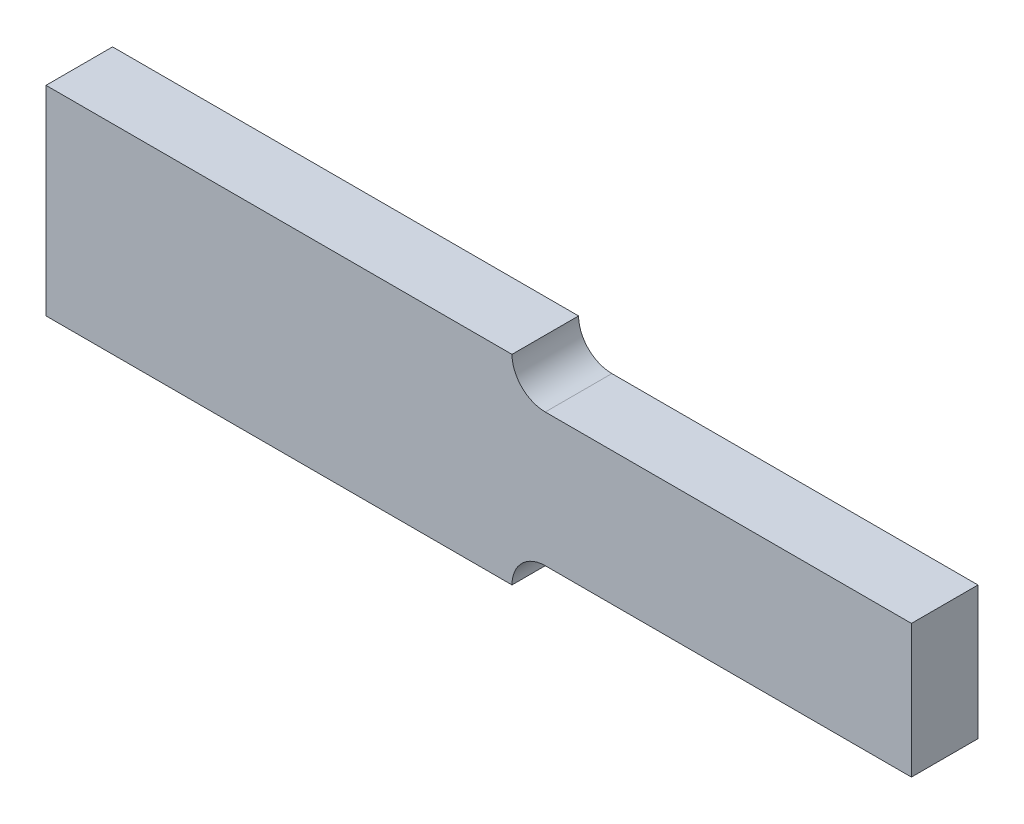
ISO-10303-21;
HEADER;
FILE_DESCRIPTION(('STEP AP214'),'2;1');
FILE_NAME('part.step','',(''),(''),'','','');
FILE_SCHEMA(('AUTOMOTIVE_DESIGN { 1 0 10303 214 1 1 1 1 }'));
ENDSEC;
DATA;
#1=APPLICATION_CONTEXT('core data for automotive mechanical design processes');
#2=APPLICATION_PROTOCOL_DEFINITION('international standard','automotive_design',2000,#1);
#3=PRODUCT_CONTEXT('',#1,'mechanical');
#4=PRODUCT('Part','Part','',(#3));
#5=PRODUCT_RELATED_PRODUCT_CATEGORY('part','',(#4));
#6=PRODUCT_DEFINITION_FORMATION('','',#4);
#7=PRODUCT_DEFINITION_CONTEXT('part definition',#1,'design');
#8=PRODUCT_DEFINITION('design','',#6,#7);
#9=PRODUCT_DEFINITION_SHAPE('','',#8);
#10=(LENGTH_UNIT() NAMED_UNIT(*) SI_UNIT(.MILLI.,.METRE.));
#11=(NAMED_UNIT(*) PLANE_ANGLE_UNIT() SI_UNIT($,.RADIAN.));
#12=(NAMED_UNIT(*) SI_UNIT($,.STERADIAN.) SOLID_ANGLE_UNIT());
#13=UNCERTAINTY_MEASURE_WITH_UNIT(LENGTH_MEASURE(1.E-05),#10,'distance_accuracy_value','');
#14=(GEOMETRIC_REPRESENTATION_CONTEXT(3) GLOBAL_UNCERTAINTY_ASSIGNED_CONTEXT((#13)) GLOBAL_UNIT_ASSIGNED_CONTEXT((#10,
#11,#12)) REPRESENTATION_CONTEXT('',''));
#15=CARTESIAN_POINT('',(0.,0.,0.));
#16=DIRECTION('',(0.,0.,1.));
#17=DIRECTION('',(1.,0.,0.));
#18=AXIS2_PLACEMENT_3D('',#15,#16,#17);
#19=CARTESIAN_POINT('',(140.,-30.,20.));
#20=DIRECTION('',(0.,1.,0.));
#21=DIRECTION('',(0.,0.,1.));
#22=AXIS2_PLACEMENT_3D('',#19,#20,#21);
#23=PLANE('',#22);
#24=DIRECTION('',(1.,0.,0.));
#25=VECTOR('',#24,1.);
#26=CARTESIAN_POINT('',(140.,-30.,0.));
#27=LINE('',#26,#25);
#28=CARTESIAN_POINT('',(0.,-30.,0.));
#29=VERTEX_POINT('',#28);
#30=CARTESIAN_POINT('',(140.,-30.,0.));
#31=VERTEX_POINT('',#30);
#32=EDGE_CURVE('E114',#29,#31,#27,.T.);
#33=ORIENTED_EDGE('',*,*,#32,.T.);
#34=DIRECTION('',(0.,0.,-1.));
#35=VECTOR('',#34,1.);
#36=CARTESIAN_POINT('',(140.,-30.,20.));
#37=LINE('',#36,#35);
#38=CARTESIAN_POINT('',(140.,-30.,20.));
#39=VERTEX_POINT('',#38);
#40=EDGE_CURVE('E112',#39,#31,#37,.T.);
#41=ORIENTED_EDGE('',*,*,#40,.F.);
#42=DIRECTION('',(1.,0.,0.));
#43=VECTOR('',#42,1.);
#44=CARTESIAN_POINT('',(140.,-30.,20.));
#45=LINE('',#44,#43);
#46=CARTESIAN_POINT('',(0.,-30.,20.));
#47=VERTEX_POINT('',#46);
#48=EDGE_CURVE('E96',#47,#39,#45,.T.);
#49=ORIENTED_EDGE('',*,*,#48,.F.);
#50=DIRECTION('',(0.,0.,-1.));
#51=VECTOR('',#50,1.);
#52=CARTESIAN_POINT('',(0.,-30.,20.));
#53=LINE('',#52,#51);
#54=EDGE_CURVE('E139',#47,#29,#53,.T.);
#55=ORIENTED_EDGE('',*,*,#54,.T.);
#56=EDGE_LOOP('',(#33,#41,#49,#55));
#57=FACE_BOUND('',#56,.T.);
#58=ADVANCED_FACE('F32',(#57),#23,.F.);
#59=CARTESIAN_POINT('',(260.,-20.,20.));
#60=DIRECTION('',(0.,1.,0.));
#61=DIRECTION('',(-1.,0.,0.));
#62=AXIS2_PLACEMENT_3D('',#59,#60,#61);
#63=PLANE('',#62);
#64=DIRECTION('',(1.,0.,0.));
#65=VECTOR('',#64,1.);
#66=CARTESIAN_POINT('',(260.,-20.,20.));
#67=LINE('',#66,#65);
#68=CARTESIAN_POINT('',(150.,-20.,20.));
#69=VERTEX_POINT('',#68);
#70=CARTESIAN_POINT('',(260.,-20.,20.));
#71=VERTEX_POINT('',#70);
#72=EDGE_CURVE('E107',#69,#71,#67,.T.);
#73=ORIENTED_EDGE('',*,*,#72,.F.);
#74=DIRECTION('',(0.,0.,-1.));
#75=VECTOR('',#74,1.);
#76=CARTESIAN_POINT('',(150.,-20.,0.));
#77=LINE('',#76,#75);
#78=CARTESIAN_POINT('',(150.,-20.,0.));
#79=VERTEX_POINT('',#78);
#80=EDGE_CURVE('E116',#69,#79,#77,.T.);
#81=ORIENTED_EDGE('',*,*,#80,.T.);
#82=DIRECTION('',(1.,0.,0.));
#83=VECTOR('',#82,1.);
#84=CARTESIAN_POINT('',(260.,-20.,0.));
#85=LINE('',#84,#83);
#86=CARTESIAN_POINT('',(260.,-20.,0.));
#87=VERTEX_POINT('',#86);
#88=EDGE_CURVE('E148',#79,#87,#85,.T.);
#89=ORIENTED_EDGE('',*,*,#88,.T.);
#90=DIRECTION('',(0.,0.,-1.));
#91=VECTOR('',#90,1.);
#92=CARTESIAN_POINT('',(260.,-20.,20.));
#93=LINE('',#92,#91);
#94=EDGE_CURVE('E117',#71,#87,#93,.T.);
#95=ORIENTED_EDGE('',*,*,#94,.F.);
#96=EDGE_LOOP('',(#73,#81,#89,#95));
#97=FACE_BOUND('',#96,.T.);
#98=ADVANCED_FACE('F162',(#97),#63,.F.);
#99=CARTESIAN_POINT('',(260.,20.,20.));
#100=DIRECTION('',(-1.,0.,0.));
#101=DIRECTION('',(0.,0.,1.));
#102=AXIS2_PLACEMENT_3D('',#99,#100,#101);
#103=PLANE('',#102);
#104=DIRECTION('',(0.,1.,0.));
#105=VECTOR('',#104,1.);
#106=CARTESIAN_POINT('',(260.,20.,0.));
#107=LINE('',#106,#105);
#108=CARTESIAN_POINT('',(260.,20.,0.));
#109=VERTEX_POINT('',#108);
#110=EDGE_CURVE('E146',#87,#109,#107,.T.);
#111=ORIENTED_EDGE('',*,*,#110,.T.);
#112=DIRECTION('',(0.,0.,-1.));
#113=VECTOR('',#112,1.);
#114=CARTESIAN_POINT('',(260.,20.,20.));
#115=LINE('',#114,#113);
#116=CARTESIAN_POINT('',(260.,20.,20.));
#117=VERTEX_POINT('',#116);
#118=EDGE_CURVE('E130',#117,#109,#115,.T.);
#119=ORIENTED_EDGE('',*,*,#118,.F.);
#120=DIRECTION('',(0.,1.,0.));
#121=VECTOR('',#120,1.);
#122=CARTESIAN_POINT('',(260.,20.,20.));
#123=LINE('',#122,#121);
#124=EDGE_CURVE('E156',#71,#117,#123,.T.);
#125=ORIENTED_EDGE('',*,*,#124,.F.);
#126=ORIENTED_EDGE('',*,*,#94,.T.);
#127=EDGE_LOOP('',(#111,#119,#125,#126));
#128=FACE_BOUND('',#127,.T.);
#129=ADVANCED_FACE('F166',(#128),#103,.F.);
#130=CARTESIAN_POINT('',(140.,20.,20.));
#131=DIRECTION('',(0.,-1.,0.));
#132=DIRECTION('',(1.,0.,0.));
#133=AXIS2_PLACEMENT_3D('',#130,#131,#132);
#134=PLANE('',#133);
#135=DIRECTION('',(-1.,0.,0.));
#136=VECTOR('',#135,1.);
#137=CARTESIAN_POINT('',(140.,20.,0.));
#138=LINE('',#137,#136);
#139=CARTESIAN_POINT('',(150.,20.,0.));
#140=VERTEX_POINT('',#139);
#141=EDGE_CURVE('E144',#109,#140,#138,.T.);
#142=ORIENTED_EDGE('',*,*,#141,.T.);
#143=DIRECTION('',(0.,0.,-1.));
#144=VECTOR('',#143,1.);
#145=CARTESIAN_POINT('',(150.,20.,20.));
#146=LINE('',#145,#144);
#147=CARTESIAN_POINT('',(150.,20.,20.));
#148=VERTEX_POINT('',#147);
#149=EDGE_CURVE('E47',#140,#148,#146,.F.);
#150=ORIENTED_EDGE('',*,*,#149,.T.);
#151=DIRECTION('',(-1.,0.,0.));
#152=VECTOR('',#151,1.);
#153=CARTESIAN_POINT('',(140.,20.,20.));
#154=LINE('',#153,#152);
#155=EDGE_CURVE('E154',#117,#148,#154,.T.);
#156=ORIENTED_EDGE('',*,*,#155,.F.);
#157=ORIENTED_EDGE('',*,*,#118,.T.);
#158=EDGE_LOOP('',(#142,#150,#156,#157));
#159=FACE_BOUND('',#158,.T.);
#160=ADVANCED_FACE('F167',(#159),#134,.F.);
#161=CARTESIAN_POINT('',(0.,30.,20.));
#162=DIRECTION('',(0.,-1.,0.));
#163=DIRECTION('',(0.,0.,-1.));
#164=AXIS2_PLACEMENT_3D('',#161,#162,#163);
#165=PLANE('',#164);
#166=DIRECTION('',(-1.,0.,0.));
#167=VECTOR('',#166,1.);
#168=CARTESIAN_POINT('',(0.,30.,0.));
#169=LINE('',#168,#167);
#170=CARTESIAN_POINT('',(140.,30.,0.));
#171=VERTEX_POINT('',#170);
#172=CARTESIAN_POINT('',(0.,30.,0.));
#173=VERTEX_POINT('',#172);
#174=EDGE_CURVE('E142',#171,#173,#169,.T.);
#175=ORIENTED_EDGE('',*,*,#174,.T.);
#176=DIRECTION('',(0.,0.,-1.));
#177=VECTOR('',#176,1.);
#178=CARTESIAN_POINT('',(0.,30.,20.));
#179=LINE('',#178,#177);
#180=CARTESIAN_POINT('',(0.,30.,20.));
#181=VERTEX_POINT('',#180);
#182=EDGE_CURVE('E136',#181,#173,#179,.T.);
#183=ORIENTED_EDGE('',*,*,#182,.F.);
#184=DIRECTION('',(-1.,0.,0.));
#185=VECTOR('',#184,1.);
#186=CARTESIAN_POINT('',(0.,30.,20.));
#187=LINE('',#186,#185);
#188=CARTESIAN_POINT('',(140.,30.,20.));
#189=VERTEX_POINT('',#188);
#190=EDGE_CURVE('E152',#189,#181,#187,.T.);
#191=ORIENTED_EDGE('',*,*,#190,.F.);
#192=DIRECTION('',(0.,0.,-1.));
#193=VECTOR('',#192,1.);
#194=CARTESIAN_POINT('',(140.,30.,20.));
#195=LINE('',#194,#193);
#196=EDGE_CURVE('E133',#189,#171,#195,.T.);
#197=ORIENTED_EDGE('',*,*,#196,.T.);
#198=EDGE_LOOP('',(#175,#183,#191,#197));
#199=FACE_BOUND('',#198,.T.);
#200=ADVANCED_FACE('F173',(#199),#165,.F.);
#201=CARTESIAN_POINT('',(0.,-30.,20.));
#202=DIRECTION('',(1.,0.,0.));
#203=DIRECTION('',(0.,0.,-1.));
#204=AXIS2_PLACEMENT_3D('',#201,#202,#203);
#205=PLANE('',#204);
#206=DIRECTION('',(0.,-1.,0.));
#207=VECTOR('',#206,1.);
#208=CARTESIAN_POINT('',(0.,-30.,0.));
#209=LINE('',#208,#207);
#210=EDGE_CURVE('E108',#173,#29,#209,.T.);
#211=ORIENTED_EDGE('',*,*,#210,.T.);
#212=ORIENTED_EDGE('',*,*,#54,.F.);
#213=DIRECTION('',(0.,-1.,0.));
#214=VECTOR('',#213,1.);
#215=CARTESIAN_POINT('',(0.,-30.,20.));
#216=LINE('',#215,#214);
#217=EDGE_CURVE('E103',#181,#47,#216,.T.);
#218=ORIENTED_EDGE('',*,*,#217,.F.);
#219=ORIENTED_EDGE('',*,*,#182,.T.);
#220=EDGE_LOOP('',(#211,#212,#218,#219));
#221=FACE_BOUND('',#220,.T.);
#222=ADVANCED_FACE('F178',(#221),#205,.F.);
#223=CARTESIAN_POINT('',(0.,0.,20.));
#224=DIRECTION('',(0.,0.,-1.));
#225=DIRECTION('',(-1.,0.,0.));
#226=AXIS2_PLACEMENT_3D('',#223,#224,#225);
#227=PLANE('',#226);
#228=ORIENTED_EDGE('',*,*,#48,.T.);
#229=CARTESIAN_POINT('',(150.,-30.,20.));
#230=DIRECTION('',(0.,0.,-1.));
#231=DIRECTION('',(-1.,0.,0.));
#232=AXIS2_PLACEMENT_3D('',#229,#230,#231);
#233=CIRCLE('',#232,10.);
#234=EDGE_CURVE('E100',#39,#69,#233,.T.);
#235=ORIENTED_EDGE('',*,*,#234,.T.);
#236=ORIENTED_EDGE('',*,*,#72,.T.);
#237=ORIENTED_EDGE('',*,*,#124,.T.);
#238=ORIENTED_EDGE('',*,*,#155,.T.);
#239=CARTESIAN_POINT('',(150.,30.,20.));
#240=DIRECTION('',(0.,0.,-1.));
#241=DIRECTION('',(-1.,0.,0.));
#242=AXIS2_PLACEMENT_3D('',#239,#240,#241);
#243=CIRCLE('',#242,10.);
#244=EDGE_CURVE('E11',#148,#189,#243,.T.);
#245=ORIENTED_EDGE('',*,*,#244,.T.);
#246=ORIENTED_EDGE('',*,*,#190,.T.);
#247=ORIENTED_EDGE('',*,*,#217,.T.);
#248=EDGE_LOOP('',(#228,#235,#236,#237,#238,#245,#246,#247));
#249=FACE_BOUND('',#248,.T.);
#250=ADVANCED_FACE('F98',(#249),#227,.F.);
#251=CARTESIAN_POINT('',(0.,0.,0.));
#252=DIRECTION('',(0.,0.,-1.));
#253=DIRECTION('',(-1.,0.,0.));
#254=AXIS2_PLACEMENT_3D('',#251,#252,#253);
#255=PLANE('',#254);
#256=ORIENTED_EDGE('',*,*,#32,.F.);
#257=ORIENTED_EDGE('',*,*,#210,.F.);
#258=ORIENTED_EDGE('',*,*,#174,.F.);
#259=CARTESIAN_POINT('',(150.,30.,0.));
#260=DIRECTION('',(0.,0.,-1.));
#261=DIRECTION('',(-1.,0.,0.));
#262=AXIS2_PLACEMENT_3D('',#259,#260,#261);
#263=CIRCLE('',#262,10.);
#264=EDGE_CURVE('E40',#171,#140,#263,.F.);
#265=ORIENTED_EDGE('',*,*,#264,.T.);
#266=ORIENTED_EDGE('',*,*,#141,.F.);
#267=ORIENTED_EDGE('',*,*,#110,.F.);
#268=ORIENTED_EDGE('',*,*,#88,.F.);
#269=CARTESIAN_POINT('',(150.,-30.,0.));
#270=DIRECTION('',(0.,0.,-1.));
#271=DIRECTION('',(-1.,0.,0.));
#272=AXIS2_PLACEMENT_3D('',#269,#270,#271);
#273=CIRCLE('',#272,10.);
#274=EDGE_CURVE('E122',#79,#31,#273,.F.);
#275=ORIENTED_EDGE('',*,*,#274,.T.);
#276=EDGE_LOOP('',(#256,#257,#258,#265,#266,#267,#268,#275));
#277=FACE_BOUND('',#276,.T.);
#278=ADVANCED_FACE('F176',(#277),#255,.T.);
#279=CARTESIAN_POINT('',(150.,-30.,20.));
#280=DIRECTION('',(0.,0.,1.));
#281=DIRECTION('',(1.,0.,0.));
#282=AXIS2_PLACEMENT_3D('',#279,#280,#281);
#283=CYLINDRICAL_SURFACE('',#282,10.);
#284=ORIENTED_EDGE('',*,*,#234,.F.);
#285=ORIENTED_EDGE('',*,*,#40,.T.);
#286=ORIENTED_EDGE('',*,*,#274,.F.);
#287=ORIENTED_EDGE('',*,*,#80,.F.);
#288=EDGE_LOOP('',(#284,#285,#286,#287));
#289=FACE_BOUND('',#288,.T.);
#290=ADVANCED_FACE('F120',(#289),#283,.F.);
#291=CARTESIAN_POINT('',(150.,30.,20.));
#292=DIRECTION('',(0.,0.,1.));
#293=DIRECTION('',(1.,0.,0.));
#294=AXIS2_PLACEMENT_3D('',#291,#292,#293);
#295=CYLINDRICAL_SURFACE('',#294,10.);
#296=ORIENTED_EDGE('',*,*,#244,.F.);
#297=ORIENTED_EDGE('',*,*,#149,.F.);
#298=ORIENTED_EDGE('',*,*,#264,.F.);
#299=ORIENTED_EDGE('',*,*,#196,.F.);
#300=EDGE_LOOP('',(#296,#297,#298,#299));
#301=FACE_BOUND('',#300,.T.);
#302=ADVANCED_FACE('F34',(#301),#295,.F.);
#303=CLOSED_SHELL('',(#58,#98,#129,#160,#200,#222,#250,#278,#290,#302));
#304=MANIFOLD_SOLID_BREP('B2',#303);
#305=ADVANCED_BREP_SHAPE_REPRESENTATION('',(#18,#304),#14);
#306=SHAPE_DEFINITION_REPRESENTATION(#9,#305);
ENDSEC;
END-ISO-10303-21;
